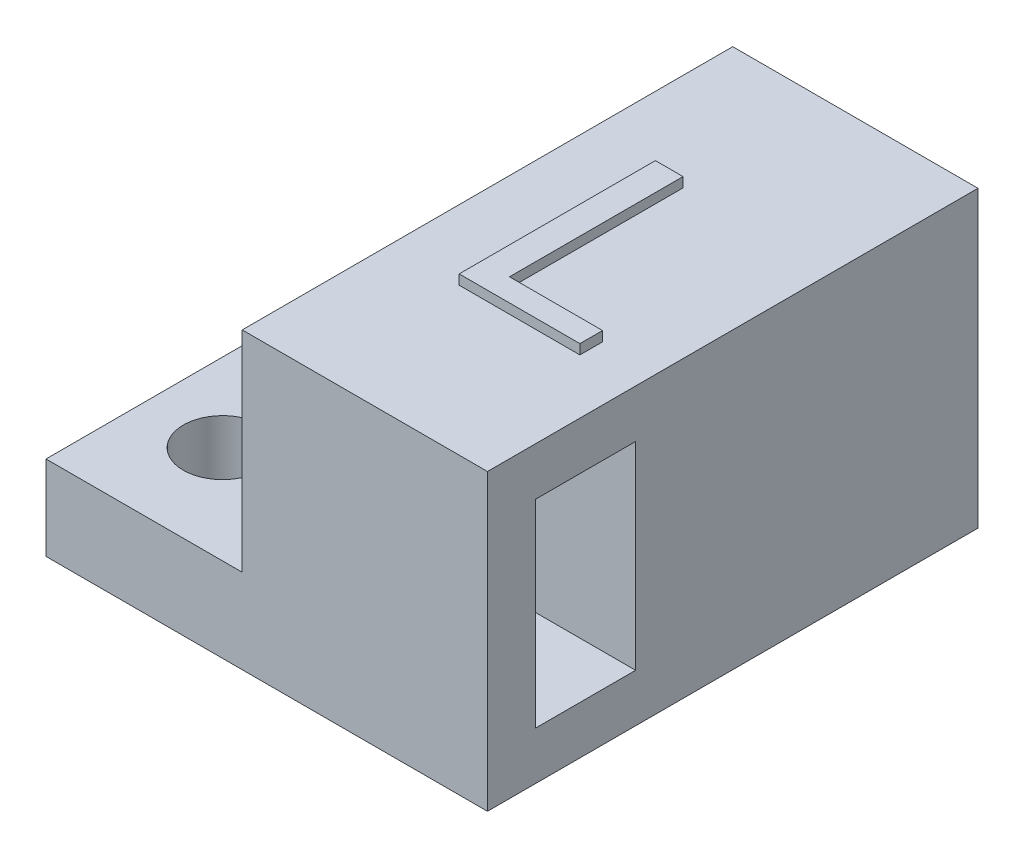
ISO-10303-21;
HEADER;
FILE_DESCRIPTION(('STEP AP214'),'2;1');
FILE_NAME('part.step','',(''),(''),'','','');
FILE_SCHEMA(('AUTOMOTIVE_DESIGN { 1 0 10303 214 1 1 1 1 }'));
ENDSEC;
DATA;
#1=APPLICATION_CONTEXT('core data for automotive mechanical design processes');
#2=APPLICATION_PROTOCOL_DEFINITION('international standard','automotive_design',2000,#1);
#3=PRODUCT_CONTEXT('',#1,'mechanical');
#4=PRODUCT('Part','Part','',(#3));
#5=PRODUCT_RELATED_PRODUCT_CATEGORY('part','',(#4));
#6=PRODUCT_DEFINITION_FORMATION('','',#4);
#7=PRODUCT_DEFINITION_CONTEXT('part definition',#1,'design');
#8=PRODUCT_DEFINITION('design','',#6,#7);
#9=PRODUCT_DEFINITION_SHAPE('','',#8);
#10=(LENGTH_UNIT() NAMED_UNIT(*) SI_UNIT(.MILLI.,.METRE.));
#11=(NAMED_UNIT(*) PLANE_ANGLE_UNIT() SI_UNIT($,.RADIAN.));
#12=(NAMED_UNIT(*) SI_UNIT($,.STERADIAN.) SOLID_ANGLE_UNIT());
#13=UNCERTAINTY_MEASURE_WITH_UNIT(LENGTH_MEASURE(1.E-05),#10,'distance_accuracy_value','');
#14=(GEOMETRIC_REPRESENTATION_CONTEXT(3) GLOBAL_UNCERTAINTY_ASSIGNED_CONTEXT((#13)) GLOBAL_UNIT_ASSIGNED_CONTEXT((#10,
#11,#12)) REPRESENTATION_CONTEXT('',''));
#15=CARTESIAN_POINT('',(0.,0.,0.));
#16=DIRECTION('',(0.,0.,1.));
#17=DIRECTION('',(1.,0.,0.));
#18=AXIS2_PLACEMENT_3D('',#15,#16,#17);
#19=CARTESIAN_POINT('',(-12.5,30.,25.));
#20=DIRECTION('',(1.,0.,0.));
#21=DIRECTION('',(0.,0.,-1.));
#22=AXIS2_PLACEMENT_3D('',#19,#20,#21);
#23=PLANE('',#22);
#24=DIRECTION('',(0.,0.,-1.));
#25=VECTOR('',#24,1.);
#26=CARTESIAN_POINT('',(-12.5,8.6050367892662,25.));
#27=LINE('',#26,#25);
#28=CARTESIAN_POINT('',(-12.5,8.6050367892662,25.));
#29=VERTEX_POINT('',#28);
#30=CARTESIAN_POINT('',(-12.5,8.6050367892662,-25.));
#31=VERTEX_POINT('',#30);
#32=EDGE_CURVE('E242',#29,#31,#27,.T.);
#33=ORIENTED_EDGE('',*,*,#32,.F.);
#34=DIRECTION('',(0.,-1.,0.));
#35=VECTOR('',#34,1.);
#36=CARTESIAN_POINT('',(-12.5,30.,25.));
#37=LINE('',#36,#35);
#38=CARTESIAN_POINT('',(-12.5,30.,25.));
#39=VERTEX_POINT('',#38);
#40=EDGE_CURVE('E11',#39,#29,#37,.T.);
#41=ORIENTED_EDGE('',*,*,#40,.F.);
#42=DIRECTION('',(0.,0.,1.));
#43=VECTOR('',#42,1.);
#44=CARTESIAN_POINT('',(-12.5,30.,25.));
#45=LINE('',#44,#43);
#46=CARTESIAN_POINT('',(-12.5,30.,-25.));
#47=VERTEX_POINT('',#46);
#48=EDGE_CURVE('E264',#47,#39,#45,.T.);
#49=ORIENTED_EDGE('',*,*,#48,.F.);
#50=DIRECTION('',(0.,-1.,0.));
#51=VECTOR('',#50,1.);
#52=CARTESIAN_POINT('',(-12.5,30.,-25.));
#53=LINE('',#52,#51);
#54=EDGE_CURVE('E274',#47,#31,#53,.T.);
#55=ORIENTED_EDGE('',*,*,#54,.T.);
#56=EDGE_LOOP('',(#33,#41,#49,#55));
#57=FACE_BOUND('',#56,.T.);
#58=ADVANCED_FACE('F34',(#57),#23,.F.);
#59=CARTESIAN_POINT('',(12.5,30.,25.));
#60=DIRECTION('',(0.,0.,-1.));
#61=DIRECTION('',(-1.,0.,0.));
#62=AXIS2_PLACEMENT_3D('',#59,#60,#61);
#63=PLANE('',#62);
#64=DIRECTION('',(1.,0.,0.));
#65=VECTOR('',#64,1.);
#66=CARTESIAN_POINT('',(12.5,0.,25.));
#67=LINE('',#66,#65);
#68=CARTESIAN_POINT('',(-32.5,0.,25.));
#69=VERTEX_POINT('',#68);
#70=CARTESIAN_POINT('',(12.5,0.,25.));
#71=VERTEX_POINT('',#70);
#72=EDGE_CURVE('E263',#69,#71,#67,.T.);
#73=ORIENTED_EDGE('',*,*,#72,.T.);
#74=DIRECTION('',(0.,-1.,0.));
#75=VECTOR('',#74,1.);
#76=CARTESIAN_POINT('',(12.5,30.,25.));
#77=LINE('',#76,#75);
#78=CARTESIAN_POINT('',(12.5,30.,25.));
#79=VERTEX_POINT('',#78);
#80=EDGE_CURVE('E41',#79,#71,#77,.T.);
#81=ORIENTED_EDGE('',*,*,#80,.F.);
#82=DIRECTION('',(1.,0.,0.));
#83=VECTOR('',#82,1.);
#84=CARTESIAN_POINT('',(12.5,30.,25.));
#85=LINE('',#84,#83);
#86=EDGE_CURVE('E267',#39,#79,#85,.T.);
#87=ORIENTED_EDGE('',*,*,#86,.F.);
#88=ORIENTED_EDGE('',*,*,#40,.T.);
#89=DIRECTION('',(1.,0.,0.));
#90=VECTOR('',#89,1.);
#91=CARTESIAN_POINT('',(-32.5,8.6050367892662,25.));
#92=LINE('',#91,#90);
#93=CARTESIAN_POINT('',(-32.5,8.6050367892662,25.));
#94=VERTEX_POINT('',#93);
#95=EDGE_CURVE('E260',#94,#29,#92,.T.);
#96=ORIENTED_EDGE('',*,*,#95,.F.);
#97=DIRECTION('',(0.,1.,0.));
#98=VECTOR('',#97,1.);
#99=CARTESIAN_POINT('',(-32.5,8.6050367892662,25.));
#100=LINE('',#99,#98);
#101=EDGE_CURVE('E251',#69,#94,#100,.T.);
#102=ORIENTED_EDGE('',*,*,#101,.F.);
#103=EDGE_LOOP('',(#73,#81,#87,#88,#96,#102));
#104=FACE_BOUND('',#103,.T.);
#105=ADVANCED_FACE('F303',(#104),#63,.F.);
#106=CARTESIAN_POINT('',(12.5,30.,25.));
#107=DIRECTION('',(-1.,0.,0.));
#108=DIRECTION('',(0.,0.,1.));
#109=AXIS2_PLACEMENT_3D('',#106,#107,#108);
#110=PLANE('',#109);
#111=DIRECTION('',(0.,0.,-1.));
#112=VECTOR('',#111,1.);
#113=CARTESIAN_POINT('',(12.5,4.9,9.90000000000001));
#114=LINE('',#113,#112);
#115=CARTESIAN_POINT('',(12.5,4.9,20.1));
#116=VERTEX_POINT('',#115);
#117=CARTESIAN_POINT('',(12.5,4.9,9.90000000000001));
#118=VERTEX_POINT('',#117);
#119=EDGE_CURVE('E216',#116,#118,#114,.T.);
#120=ORIENTED_EDGE('',*,*,#119,.F.);
#121=DIRECTION('',(0.,-1.,0.));
#122=VECTOR('',#121,1.);
#123=CARTESIAN_POINT('',(12.5,4.9,20.1));
#124=LINE('',#123,#122);
#125=CARTESIAN_POINT('',(12.5,25.1,20.1));
#126=VERTEX_POINT('',#125);
#127=EDGE_CURVE('E191',#126,#116,#124,.T.);
#128=ORIENTED_EDGE('',*,*,#127,.F.);
#129=DIRECTION('',(0.,0.,1.));
#130=VECTOR('',#129,1.);
#131=CARTESIAN_POINT('',(12.5,25.1,9.90000000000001));
#132=LINE('',#131,#130);
#133=CARTESIAN_POINT('',(12.5,25.1,9.90000000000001));
#134=VERTEX_POINT('',#133);
#135=EDGE_CURVE('E205',#134,#126,#132,.T.);
#136=ORIENTED_EDGE('',*,*,#135,.F.);
#137=DIRECTION('',(0.,1.,0.));
#138=VECTOR('',#137,1.);
#139=CARTESIAN_POINT('',(12.5,4.9,9.90000000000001));
#140=LINE('',#139,#138);
#141=EDGE_CURVE('E219',#118,#134,#140,.T.);
#142=ORIENTED_EDGE('',*,*,#141,.F.);
#143=EDGE_LOOP('',(#120,#128,#136,#142));
#144=FACE_BOUND('',#143,.T.);
#145=DIRECTION('',(0.,0.,-1.));
#146=VECTOR('',#145,1.);
#147=CARTESIAN_POINT('',(12.5,0.,25.));
#148=LINE('',#147,#146);
#149=CARTESIAN_POINT('',(12.5,0.,-25.));
#150=VERTEX_POINT('',#149);
#151=EDGE_CURVE('E276',#71,#150,#148,.T.);
#152=ORIENTED_EDGE('',*,*,#151,.T.);
#153=DIRECTION('',(0.,-1.,0.));
#154=VECTOR('',#153,1.);
#155=CARTESIAN_POINT('',(12.5,30.,-25.));
#156=LINE('',#155,#154);
#157=CARTESIAN_POINT('',(12.5,30.,-25.));
#158=VERTEX_POINT('',#157);
#159=EDGE_CURVE('E280',#158,#150,#156,.T.);
#160=ORIENTED_EDGE('',*,*,#159,.F.);
#161=DIRECTION('',(0.,0.,-1.));
#162=VECTOR('',#161,1.);
#163=CARTESIAN_POINT('',(12.5,30.,25.));
#164=LINE('',#163,#162);
#165=EDGE_CURVE('E270',#79,#158,#164,.T.);
#166=ORIENTED_EDGE('',*,*,#165,.F.);
#167=ORIENTED_EDGE('',*,*,#80,.T.);
#168=EDGE_LOOP('',(#152,#160,#166,#167));
#169=FACE_BOUND('',#168,.T.);
#170=ADVANCED_FACE('F287',(#144,#169),#110,.F.);
#171=CARTESIAN_POINT('',(12.5,30.,-25.));
#172=DIRECTION('',(0.,0.,1.));
#173=DIRECTION('',(1.,0.,0.));
#174=AXIS2_PLACEMENT_3D('',#171,#172,#173);
#175=PLANE('',#174);
#176=DIRECTION('',(-1.,0.,0.));
#177=VECTOR('',#176,1.);
#178=CARTESIAN_POINT('',(12.5,0.,-25.));
#179=LINE('',#178,#177);
#180=CARTESIAN_POINT('',(-32.5,0.,-25.));
#181=VERTEX_POINT('',#180);
#182=EDGE_CURVE('E268',#150,#181,#179,.T.);
#183=ORIENTED_EDGE('',*,*,#182,.T.);
#184=DIRECTION('',(0.,-1.,0.));
#185=VECTOR('',#184,1.);
#186=CARTESIAN_POINT('',(-32.5,8.6050367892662,-25.));
#187=LINE('',#186,#185);
#188=CARTESIAN_POINT('',(-32.5,8.6050367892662,-25.));
#189=VERTEX_POINT('',#188);
#190=EDGE_CURVE('E245',#189,#181,#187,.T.);
#191=ORIENTED_EDGE('',*,*,#190,.F.);
#192=DIRECTION('',(1.,0.,0.));
#193=VECTOR('',#192,1.);
#194=CARTESIAN_POINT('',(-32.5,8.6050367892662,-25.));
#195=LINE('',#194,#193);
#196=EDGE_CURVE('E255',#189,#31,#195,.T.);
#197=ORIENTED_EDGE('',*,*,#196,.T.);
#198=ORIENTED_EDGE('',*,*,#54,.F.);
#199=DIRECTION('',(-1.,0.,0.));
#200=VECTOR('',#199,1.);
#201=CARTESIAN_POINT('',(12.5,30.,-25.));
#202=LINE('',#201,#200);
#203=EDGE_CURVE('E272',#158,#47,#202,.T.);
#204=ORIENTED_EDGE('',*,*,#203,.F.);
#205=ORIENTED_EDGE('',*,*,#159,.T.);
#206=EDGE_LOOP('',(#183,#191,#197,#198,#204,#205));
#207=FACE_BOUND('',#206,.T.);
#208=ADVANCED_FACE('F296',(#207),#175,.F.);
#209=CARTESIAN_POINT('',(0.,30.,0.));
#210=DIRECTION('',(0.,1.,0.));
#211=DIRECTION('',(0.,0.,1.));
#212=AXIS2_PLACEMENT_3D('',#209,#210,#211);
#213=PLANE('',#212);
#214=DIRECTION('',(-1.,0.,0.));
#215=VECTOR('',#214,1.);
#216=CARTESIAN_POINT('',(6.92307692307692,30.,10.));
#217=LINE('',#216,#215);
#218=CARTESIAN_POINT('',(6.92307692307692,30.,10.));
#219=VERTEX_POINT('',#218);
#220=CARTESIAN_POINT('',(-5.38461538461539,30.,10.));
#221=VERTEX_POINT('',#220);
#222=EDGE_CURVE('E182',#219,#221,#217,.T.);
#223=ORIENTED_EDGE('',*,*,#222,.T.);
#224=DIRECTION('',(0.,0.,-1.));
#225=VECTOR('',#224,1.);
#226=CARTESIAN_POINT('',(-5.38461538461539,30.,10.));
#227=LINE('',#226,#225);
#228=CARTESIAN_POINT('',(-5.38461538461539,30.,-9.99999999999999));
#229=VERTEX_POINT('',#228);
#230=EDGE_CURVE('E151',#221,#229,#227,.T.);
#231=ORIENTED_EDGE('',*,*,#230,.T.);
#232=DIRECTION('',(1.,0.,0.));
#233=VECTOR('',#232,1.);
#234=CARTESIAN_POINT('',(-5.38461538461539,30.,-9.99999999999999));
#235=LINE('',#234,#233);
#236=CARTESIAN_POINT('',(-2.56410256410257,30.,-9.99999999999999));
#237=VERTEX_POINT('',#236);
#238=EDGE_CURVE('E185',#229,#237,#235,.T.);
#239=ORIENTED_EDGE('',*,*,#238,.T.);
#240=DIRECTION('',(0.,0.,1.));
#241=VECTOR('',#240,1.);
#242=CARTESIAN_POINT('',(-2.56410256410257,30.,-9.99999999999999));
#243=LINE('',#242,#241);
#244=CARTESIAN_POINT('',(-2.56410256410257,30.,7.6923076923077));
#245=VERTEX_POINT('',#244);
#246=EDGE_CURVE('E187',#237,#245,#243,.T.);
#247=ORIENTED_EDGE('',*,*,#246,.T.);
#248=DIRECTION('',(1.,0.,0.));
#249=VECTOR('',#248,1.);
#250=CARTESIAN_POINT('',(-2.56410256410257,30.,7.6923076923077));
#251=LINE('',#250,#249);
#252=CARTESIAN_POINT('',(6.92307692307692,30.,7.6923076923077));
#253=VERTEX_POINT('',#252);
#254=EDGE_CURVE('E53',#245,#253,#251,.T.);
#255=ORIENTED_EDGE('',*,*,#254,.T.);
#256=DIRECTION('',(0.,0.,1.));
#257=VECTOR('',#256,1.);
#258=CARTESIAN_POINT('',(6.92307692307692,30.,7.6923076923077));
#259=LINE('',#258,#257);
#260=EDGE_CURVE('E48',#253,#219,#259,.T.);
#261=ORIENTED_EDGE('',*,*,#260,.T.);
#262=EDGE_LOOP('',(#223,#231,#239,#247,#255,#261));
#263=FACE_BOUND('',#262,.T.);
#264=ORIENTED_EDGE('',*,*,#48,.T.);
#265=ORIENTED_EDGE('',*,*,#86,.T.);
#266=ORIENTED_EDGE('',*,*,#165,.T.);
#267=ORIENTED_EDGE('',*,*,#203,.T.);
#268=EDGE_LOOP('',(#264,#265,#266,#267));
#269=FACE_BOUND('',#268,.T.);
#270=ADVANCED_FACE('F301',(#263,#269),#213,.T.);
#271=CARTESIAN_POINT('',(0.,0.,0.));
#272=DIRECTION('',(0.,1.,0.));
#273=DIRECTION('',(0.,0.,1.));
#274=AXIS2_PLACEMENT_3D('',#271,#272,#273);
#275=PLANE('',#274);
#276=CARTESIAN_POINT('',(-24.5,0.,15.));
#277=DIRECTION('',(0.,1.,0.));
#278=DIRECTION('',(0.,0.,1.));
#279=AXIS2_PLACEMENT_3D('',#276,#277,#278);
#280=CIRCLE('',#279,4.);
#281=CARTESIAN_POINT('',(-24.5,0.,19.));
#282=VERTEX_POINT('',#281);
#283=EDGE_CURVE('E233',#282,#282,#280,.T.);
#284=ORIENTED_EDGE('',*,*,#283,.T.);
#285=EDGE_LOOP('',(#284));
#286=FACE_BOUND('',#285,.T.);
#287=CARTESIAN_POINT('',(-24.5,0.,-15.));
#288=DIRECTION('',(0.,1.,0.));
#289=DIRECTION('',(0.,0.,1.));
#290=AXIS2_PLACEMENT_3D('',#287,#288,#289);
#291=CIRCLE('',#290,4.);
#292=CARTESIAN_POINT('',(-24.5,0.,-11.));
#293=VERTEX_POINT('',#292);
#294=EDGE_CURVE('E239',#293,#293,#291,.T.);
#295=ORIENTED_EDGE('',*,*,#294,.T.);
#296=EDGE_LOOP('',(#295));
#297=FACE_BOUND('',#296,.T.);
#298=ORIENTED_EDGE('',*,*,#72,.F.);
#299=DIRECTION('',(0.,0.,1.));
#300=VECTOR('',#299,1.);
#301=CARTESIAN_POINT('',(-32.5,0.,25.));
#302=LINE('',#301,#300);
#303=EDGE_CURVE('E248',#181,#69,#302,.T.);
#304=ORIENTED_EDGE('',*,*,#303,.F.);
#305=ORIENTED_EDGE('',*,*,#182,.F.);
#306=ORIENTED_EDGE('',*,*,#151,.F.);
#307=EDGE_LOOP('',(#298,#304,#305,#306));
#308=FACE_BOUND('',#307,.T.);
#309=ADVANCED_FACE('F292',(#286,#297,#308),#275,.F.);
#310=CARTESIAN_POINT('',(-32.5,8.6050367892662,25.));
#311=DIRECTION('',(0.,-1.,0.));
#312=DIRECTION('',(0.,0.,-1.));
#313=AXIS2_PLACEMENT_3D('',#310,#311,#312);
#314=PLANE('',#313);
#315=CARTESIAN_POINT('',(-24.5,8.6050367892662,15.));
#316=DIRECTION('',(0.,1.,0.));
#317=DIRECTION('',(0.,0.,1.));
#318=AXIS2_PLACEMENT_3D('',#315,#316,#317);
#319=CIRCLE('',#318,4.);
#320=CARTESIAN_POINT('',(-24.5,8.6050367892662,19.));
#321=VERTEX_POINT('',#320);
#322=EDGE_CURVE('E226',#321,#321,#319,.T.);
#323=ORIENTED_EDGE('',*,*,#322,.F.);
#324=EDGE_LOOP('',(#323));
#325=FACE_BOUND('',#324,.T.);
#326=CARTESIAN_POINT('',(-24.5,8.6050367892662,-15.));
#327=DIRECTION('',(0.,1.,0.));
#328=DIRECTION('',(0.,0.,1.));
#329=AXIS2_PLACEMENT_3D('',#326,#327,#328);
#330=CIRCLE('',#329,4.);
#331=CARTESIAN_POINT('',(-24.5,8.6050367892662,-11.));
#332=VERTEX_POINT('',#331);
#333=EDGE_CURVE('E236',#332,#332,#330,.T.);
#334=ORIENTED_EDGE('',*,*,#333,.F.);
#335=EDGE_LOOP('',(#334));
#336=FACE_BOUND('',#335,.T.);
#337=ORIENTED_EDGE('',*,*,#32,.T.);
#338=ORIENTED_EDGE('',*,*,#196,.F.);
#339=DIRECTION('',(0.,0.,-1.));
#340=VECTOR('',#339,1.);
#341=CARTESIAN_POINT('',(-32.5,8.6050367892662,25.));
#342=LINE('',#341,#340);
#343=EDGE_CURVE('E253',#94,#189,#342,.T.);
#344=ORIENTED_EDGE('',*,*,#343,.F.);
#345=ORIENTED_EDGE('',*,*,#95,.T.);
#346=EDGE_LOOP('',(#337,#338,#344,#345));
#347=FACE_BOUND('',#346,.T.);
#348=ADVANCED_FACE('F309',(#325,#336,#347),#314,.F.);
#349=CARTESIAN_POINT('',(-32.5,0.,0.));
#350=DIRECTION('',(1.,0.,0.));
#351=DIRECTION('',(0.,0.,-1.));
#352=AXIS2_PLACEMENT_3D('',#349,#350,#351);
#353=PLANE('',#352);
#354=ORIENTED_EDGE('',*,*,#190,.T.);
#355=ORIENTED_EDGE('',*,*,#303,.T.);
#356=ORIENTED_EDGE('',*,*,#101,.T.);
#357=ORIENTED_EDGE('',*,*,#343,.T.);
#358=EDGE_LOOP('',(#354,#355,#356,#357));
#359=FACE_BOUND('',#358,.T.);
#360=ADVANCED_FACE('F312',(#359),#353,.F.);
#361=CARTESIAN_POINT('',(-24.5,0.,-15.));
#362=DIRECTION('',(0.,1.,0.));
#363=DIRECTION('',(0.,0.,1.));
#364=AXIS2_PLACEMENT_3D('',#361,#362,#363);
#365=CYLINDRICAL_SURFACE('',#364,4.);
#366=ORIENTED_EDGE('',*,*,#294,.F.);
#367=EDGE_LOOP('',(#366));
#368=FACE_BOUND('',#367,.T.);
#369=ORIENTED_EDGE('',*,*,#333,.T.);
#370=EDGE_LOOP('',(#369));
#371=FACE_BOUND('',#370,.T.);
#372=ADVANCED_FACE('F314',(#368,#371),#365,.F.);
#373=CARTESIAN_POINT('',(-24.5,0.,15.));
#374=DIRECTION('',(0.,1.,0.));
#375=DIRECTION('',(0.,0.,1.));
#376=AXIS2_PLACEMENT_3D('',#373,#374,#375);
#377=CYLINDRICAL_SURFACE('',#376,4.);
#378=ORIENTED_EDGE('',*,*,#283,.F.);
#379=EDGE_LOOP('',(#378));
#380=FACE_BOUND('',#379,.T.);
#381=ORIENTED_EDGE('',*,*,#322,.T.);
#382=EDGE_LOOP('',(#381));
#383=FACE_BOUND('',#382,.T.);
#384=ADVANCED_FACE('F320',(#380,#383),#377,.F.);
#385=CARTESIAN_POINT('',(-7.5,4.9,20.1));
#386=DIRECTION('',(0.,0.,1.));
#387=DIRECTION('',(1.,0.,0.));
#388=AXIS2_PLACEMENT_3D('',#385,#386,#387);
#389=PLANE('',#388);
#390=ORIENTED_EDGE('',*,*,#127,.T.);
#391=DIRECTION('',(1.,0.,0.));
#392=VECTOR('',#391,1.);
#393=CARTESIAN_POINT('',(-7.5,4.9,20.1));
#394=LINE('',#393,#392);
#395=CARTESIAN_POINT('',(-7.5,4.9,20.1));
#396=VERTEX_POINT('',#395);
#397=EDGE_CURVE('E214',#396,#116,#394,.T.);
#398=ORIENTED_EDGE('',*,*,#397,.F.);
#399=DIRECTION('',(0.,-1.,0.));
#400=VECTOR('',#399,1.);
#401=CARTESIAN_POINT('',(-7.5,4.9,20.1));
#402=LINE('',#401,#400);
#403=CARTESIAN_POINT('',(-7.5,25.1,20.1));
#404=VERTEX_POINT('',#403);
#405=EDGE_CURVE('E201',#404,#396,#402,.T.);
#406=ORIENTED_EDGE('',*,*,#405,.F.);
#407=DIRECTION('',(1.,0.,0.));
#408=VECTOR('',#407,1.);
#409=CARTESIAN_POINT('',(-7.5,25.1,20.1));
#410=LINE('',#409,#408);
#411=EDGE_CURVE('E224',#404,#126,#410,.T.);
#412=ORIENTED_EDGE('',*,*,#411,.T.);
#413=EDGE_LOOP('',(#390,#398,#406,#412));
#414=FACE_BOUND('',#413,.T.);
#415=ADVANCED_FACE('F379',(#414),#389,.F.);
#416=CARTESIAN_POINT('',(-7.5,25.1,9.90000000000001));
#417=DIRECTION('',(0.,1.,0.));
#418=DIRECTION('',(0.,0.,1.));
#419=AXIS2_PLACEMENT_3D('',#416,#417,#418);
#420=PLANE('',#419);
#421=ORIENTED_EDGE('',*,*,#135,.T.);
#422=ORIENTED_EDGE('',*,*,#411,.F.);
#423=DIRECTION('',(0.,0.,1.));
#424=VECTOR('',#423,1.);
#425=CARTESIAN_POINT('',(-7.5,25.1,9.90000000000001));
#426=LINE('',#425,#424);
#427=CARTESIAN_POINT('',(-7.5,25.1,9.90000000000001));
#428=VERTEX_POINT('',#427);
#429=EDGE_CURVE('E211',#428,#404,#426,.T.);
#430=ORIENTED_EDGE('',*,*,#429,.F.);
#431=DIRECTION('',(1.,0.,0.));
#432=VECTOR('',#431,1.);
#433=CARTESIAN_POINT('',(-7.5,25.1,9.90000000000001));
#434=LINE('',#433,#432);
#435=EDGE_CURVE('E227',#428,#134,#434,.T.);
#436=ORIENTED_EDGE('',*,*,#435,.T.);
#437=EDGE_LOOP('',(#421,#422,#430,#436));
#438=FACE_BOUND('',#437,.T.);
#439=ADVANCED_FACE('F375',(#438),#420,.F.);
#440=CARTESIAN_POINT('',(-7.5,4.9,9.90000000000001));
#441=DIRECTION('',(0.,0.,-1.));
#442=DIRECTION('',(-1.,0.,0.));
#443=AXIS2_PLACEMENT_3D('',#440,#441,#442);
#444=PLANE('',#443);
#445=ORIENTED_EDGE('',*,*,#141,.T.);
#446=ORIENTED_EDGE('',*,*,#435,.F.);
#447=DIRECTION('',(0.,1.,0.));
#448=VECTOR('',#447,1.);
#449=CARTESIAN_POINT('',(-7.5,4.9,9.90000000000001));
#450=LINE('',#449,#448);
#451=CARTESIAN_POINT('',(-7.5,4.9,9.90000000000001));
#452=VERTEX_POINT('',#451);
#453=EDGE_CURVE('E208',#452,#428,#450,.T.);
#454=ORIENTED_EDGE('',*,*,#453,.F.);
#455=DIRECTION('',(1.,0.,0.));
#456=VECTOR('',#455,1.);
#457=CARTESIAN_POINT('',(-7.5,4.9,9.90000000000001));
#458=LINE('',#457,#456);
#459=EDGE_CURVE('E229',#452,#118,#458,.T.);
#460=ORIENTED_EDGE('',*,*,#459,.T.);
#461=EDGE_LOOP('',(#445,#446,#454,#460));
#462=FACE_BOUND('',#461,.T.);
#463=ADVANCED_FACE('F378',(#462),#444,.F.);
#464=CARTESIAN_POINT('',(-7.5,4.9,9.90000000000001));
#465=DIRECTION('',(0.,-1.,0.));
#466=DIRECTION('',(0.,0.,-1.));
#467=AXIS2_PLACEMENT_3D('',#464,#465,#466);
#468=PLANE('',#467);
#469=ORIENTED_EDGE('',*,*,#119,.T.);
#470=ORIENTED_EDGE('',*,*,#459,.F.);
#471=DIRECTION('',(0.,0.,-1.));
#472=VECTOR('',#471,1.);
#473=CARTESIAN_POINT('',(-7.5,4.9,9.90000000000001));
#474=LINE('',#473,#472);
#475=EDGE_CURVE('E204',#396,#452,#474,.T.);
#476=ORIENTED_EDGE('',*,*,#475,.F.);
#477=ORIENTED_EDGE('',*,*,#397,.T.);
#478=EDGE_LOOP('',(#469,#470,#476,#477));
#479=FACE_BOUND('',#478,.T.);
#480=ADVANCED_FACE('F373',(#479),#468,.F.);
#481=CARTESIAN_POINT('',(-7.5,0.,0.));
#482=DIRECTION('',(1.,0.,0.));
#483=DIRECTION('',(0.,0.,-1.));
#484=AXIS2_PLACEMENT_3D('',#481,#482,#483);
#485=PLANE('',#484);
#486=ORIENTED_EDGE('',*,*,#405,.T.);
#487=ORIENTED_EDGE('',*,*,#475,.T.);
#488=ORIENTED_EDGE('',*,*,#453,.T.);
#489=ORIENTED_EDGE('',*,*,#429,.T.);
#490=EDGE_LOOP('',(#486,#487,#488,#489));
#491=FACE_BOUND('',#490,.T.);
#492=ADVANCED_FACE('F361',(#491),#485,.T.);
#493=CARTESIAN_POINT('',(6.92307692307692,31.,10.));
#494=DIRECTION('',(0.,0.,1.));
#495=DIRECTION('',(1.,0.,0.));
#496=AXIS2_PLACEMENT_3D('',#493,#494,#495);
#497=PLANE('',#496);
#498=ORIENTED_EDGE('',*,*,#222,.F.);
#499=DIRECTION('',(0.,-1.,0.));
#500=VECTOR('',#499,1.);
#501=CARTESIAN_POINT('',(6.92307692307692,31.,10.));
#502=LINE('',#501,#500);
#503=CARTESIAN_POINT('',(6.92307692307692,31.,10.));
#504=VERTEX_POINT('',#503);
#505=EDGE_CURVE('E170',#504,#219,#502,.T.);
#506=ORIENTED_EDGE('',*,*,#505,.F.);
#507=DIRECTION('',(-1.,0.,0.));
#508=VECTOR('',#507,1.);
#509=CARTESIAN_POINT('',(6.92307692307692,31.,10.));
#510=LINE('',#509,#508);
#511=CARTESIAN_POINT('',(-5.38461538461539,31.,10.));
#512=VERTEX_POINT('',#511);
#513=EDGE_CURVE('E163',#504,#512,#510,.T.);
#514=ORIENTED_EDGE('',*,*,#513,.T.);
#515=DIRECTION('',(0.,-1.,0.));
#516=VECTOR('',#515,1.);
#517=CARTESIAN_POINT('',(-5.38461538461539,31.,10.));
#518=LINE('',#517,#516);
#519=EDGE_CURVE('E146',#512,#221,#518,.T.);
#520=ORIENTED_EDGE('',*,*,#519,.T.);
#521=EDGE_LOOP('',(#498,#506,#514,#520));
#522=FACE_BOUND('',#521,.T.);
#523=ADVANCED_FACE('F169',(#522),#497,.T.);
#524=CARTESIAN_POINT('',(6.92307692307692,31.,7.6923076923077));
#525=DIRECTION('',(1.,0.,0.));
#526=DIRECTION('',(0.,0.,-1.));
#527=AXIS2_PLACEMENT_3D('',#524,#525,#526);
#528=PLANE('',#527);
#529=ORIENTED_EDGE('',*,*,#260,.F.);
#530=DIRECTION('',(0.,-1.,0.));
#531=VECTOR('',#530,1.);
#532=CARTESIAN_POINT('',(6.92307692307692,31.,7.6923076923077));
#533=LINE('',#532,#531);
#534=CARTESIAN_POINT('',(6.92307692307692,31.,7.6923076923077));
#535=VERTEX_POINT('',#534);
#536=EDGE_CURVE('E192',#535,#253,#533,.T.);
#537=ORIENTED_EDGE('',*,*,#536,.F.);
#538=DIRECTION('',(0.,0.,1.));
#539=VECTOR('',#538,1.);
#540=CARTESIAN_POINT('',(6.92307692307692,31.,7.6923076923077));
#541=LINE('',#540,#539);
#542=EDGE_CURVE('E156',#535,#504,#541,.T.);
#543=ORIENTED_EDGE('',*,*,#542,.T.);
#544=ORIENTED_EDGE('',*,*,#505,.T.);
#545=EDGE_LOOP('',(#529,#537,#543,#544));
#546=FACE_BOUND('',#545,.T.);
#547=ADVANCED_FACE('F353',(#546),#528,.T.);
#548=CARTESIAN_POINT('',(-2.56410256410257,31.,7.6923076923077));
#549=DIRECTION('',(0.,0.,-1.));
#550=DIRECTION('',(-1.,0.,0.));
#551=AXIS2_PLACEMENT_3D('',#548,#549,#550);
#552=PLANE('',#551);
#553=ORIENTED_EDGE('',*,*,#254,.F.);
#554=DIRECTION('',(0.,-1.,0.));
#555=VECTOR('',#554,1.);
#556=CARTESIAN_POINT('',(-2.56410256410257,31.,7.6923076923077));
#557=LINE('',#556,#555);
#558=CARTESIAN_POINT('',(-2.56410256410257,31.,7.6923076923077));
#559=VERTEX_POINT('',#558);
#560=EDGE_CURVE('E194',#559,#245,#557,.T.);
#561=ORIENTED_EDGE('',*,*,#560,.F.);
#562=DIRECTION('',(1.,0.,0.));
#563=VECTOR('',#562,1.);
#564=CARTESIAN_POINT('',(-2.56410256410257,31.,7.6923076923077));
#565=LINE('',#564,#563);
#566=EDGE_CURVE('E178',#559,#535,#565,.T.);
#567=ORIENTED_EDGE('',*,*,#566,.T.);
#568=ORIENTED_EDGE('',*,*,#536,.T.);
#569=EDGE_LOOP('',(#553,#561,#567,#568));
#570=FACE_BOUND('',#569,.T.);
#571=ADVANCED_FACE('F351',(#570),#552,.T.);
#572=CARTESIAN_POINT('',(-2.56410256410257,31.,-9.99999999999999));
#573=DIRECTION('',(1.,0.,0.));
#574=DIRECTION('',(0.,0.,-1.));
#575=AXIS2_PLACEMENT_3D('',#572,#573,#574);
#576=PLANE('',#575);
#577=ORIENTED_EDGE('',*,*,#246,.F.);
#578=DIRECTION('',(0.,-1.,0.));
#579=VECTOR('',#578,1.);
#580=CARTESIAN_POINT('',(-2.56410256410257,31.,-9.99999999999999));
#581=LINE('',#580,#579);
#582=CARTESIAN_POINT('',(-2.56410256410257,31.,-9.99999999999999));
#583=VERTEX_POINT('',#582);
#584=EDGE_CURVE('E197',#583,#237,#581,.T.);
#585=ORIENTED_EDGE('',*,*,#584,.F.);
#586=DIRECTION('',(0.,0.,1.));
#587=VECTOR('',#586,1.);
#588=CARTESIAN_POINT('',(-2.56410256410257,31.,-9.99999999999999));
#589=LINE('',#588,#587);
#590=EDGE_CURVE('E175',#583,#559,#589,.T.);
#591=ORIENTED_EDGE('',*,*,#590,.T.);
#592=ORIENTED_EDGE('',*,*,#560,.T.);
#593=EDGE_LOOP('',(#577,#585,#591,#592));
#594=FACE_BOUND('',#593,.T.);
#595=ADVANCED_FACE('F348',(#594),#576,.T.);
#596=CARTESIAN_POINT('',(-5.38461538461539,31.,-9.99999999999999));
#597=DIRECTION('',(0.,0.,-1.));
#598=DIRECTION('',(-1.,0.,0.));
#599=AXIS2_PLACEMENT_3D('',#596,#597,#598);
#600=PLANE('',#599);
#601=ORIENTED_EDGE('',*,*,#238,.F.);
#602=DIRECTION('',(0.,-1.,0.));
#603=VECTOR('',#602,1.);
#604=CARTESIAN_POINT('',(-5.38461538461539,31.,-9.99999999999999));
#605=LINE('',#604,#603);
#606=CARTESIAN_POINT('',(-5.38461538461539,31.,-9.99999999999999));
#607=VERTEX_POINT('',#606);
#608=EDGE_CURVE('E155',#607,#229,#605,.T.);
#609=ORIENTED_EDGE('',*,*,#608,.F.);
#610=DIRECTION('',(1.,0.,0.));
#611=VECTOR('',#610,1.);
#612=CARTESIAN_POINT('',(-5.38461538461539,31.,-9.99999999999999));
#613=LINE('',#612,#611);
#614=EDGE_CURVE('E167',#607,#583,#613,.T.);
#615=ORIENTED_EDGE('',*,*,#614,.T.);
#616=ORIENTED_EDGE('',*,*,#584,.T.);
#617=EDGE_LOOP('',(#601,#609,#615,#616));
#618=FACE_BOUND('',#617,.T.);
#619=ADVANCED_FACE('F345',(#618),#600,.T.);
#620=CARTESIAN_POINT('',(-5.38461538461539,31.,10.));
#621=DIRECTION('',(-1.,0.,0.));
#622=DIRECTION('',(0.,0.,1.));
#623=AXIS2_PLACEMENT_3D('',#620,#621,#622);
#624=PLANE('',#623);
#625=ORIENTED_EDGE('',*,*,#230,.F.);
#626=ORIENTED_EDGE('',*,*,#519,.F.);
#627=DIRECTION('',(0.,0.,-1.));
#628=VECTOR('',#627,1.);
#629=CARTESIAN_POINT('',(-5.38461538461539,31.,10.));
#630=LINE('',#629,#628);
#631=EDGE_CURVE('E150',#512,#607,#630,.T.);
#632=ORIENTED_EDGE('',*,*,#631,.T.);
#633=ORIENTED_EDGE('',*,*,#608,.T.);
#634=EDGE_LOOP('',(#625,#626,#632,#633));
#635=FACE_BOUND('',#634,.T.);
#636=ADVANCED_FACE('F148',(#635),#624,.T.);
#637=CARTESIAN_POINT('',(0.,31.,0.));
#638=DIRECTION('',(0.,-1.,0.));
#639=DIRECTION('',(0.,0.,-1.));
#640=AXIS2_PLACEMENT_3D('',#637,#638,#639);
#641=PLANE('',#640);
#642=ORIENTED_EDGE('',*,*,#513,.F.);
#643=ORIENTED_EDGE('',*,*,#542,.F.);
#644=ORIENTED_EDGE('',*,*,#566,.F.);
#645=ORIENTED_EDGE('',*,*,#590,.F.);
#646=ORIENTED_EDGE('',*,*,#614,.F.);
#647=ORIENTED_EDGE('',*,*,#631,.F.);
#648=EDGE_LOOP('',(#642,#643,#644,#645,#646,#647));
#649=FACE_BOUND('',#648,.T.);
#650=ADVANCED_FACE('F161',(#649),#641,.F.);
#651=CLOSED_SHELL('',(#58,#105,#170,#208,#270,#309,#348,#360,#372,#384,#415,#439,#463,#480,#492,
#523,#547,#571,#595,#619,#636,#650));
#652=MANIFOLD_SOLID_BREP('B2',#651);
#653=ADVANCED_BREP_SHAPE_REPRESENTATION('',(#18,#652),#14);
#654=SHAPE_DEFINITION_REPRESENTATION(#9,#653);
ENDSEC;
END-ISO-10303-21;
